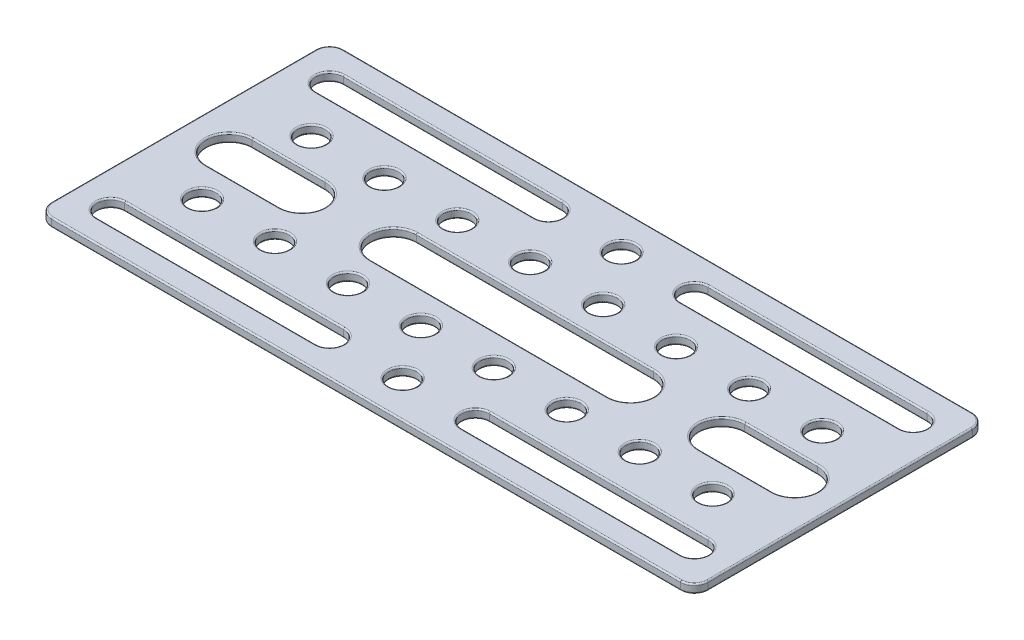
from build123d import *

# Parameters (mm, degrees)
EXTRUDE1_DEPTH          = 1.524
SKETCH2_R               = 2.413
CUT_EXTRUDE1_DEPTH      = 126.089778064
SKETCH3_R               = 2.413
CUT_EXTRUDE2_DEPTH      = 126.089778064
LPATTERN1_COUNT         = 8
LPATTERN1_PITCH         = 12.7
MIRROR1_COPY_1_SKETCH_R = 2.413
MIRROR1_COPY_1_DEPTH    = 126.089778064
MIRROR1_COPY_2_SKETCH_R = 2.413
MIRROR1_COPY_2_DEPTH    = 126.089778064
MIRROR1_COPY_3_SKETCH_R = 2.413
MIRROR1_COPY_3_DEPTH    = 126.089778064
MIRROR1_COPY_4_SKETCH_R = 2.413
MIRROR1_COPY_4_DEPTH    = 126.089778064
MIRROR1_COPY_5_SKETCH_R = 2.413
MIRROR1_COPY_5_DEPTH    = 126.089778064
MIRROR1_COPY_6_SKETCH_R = 2.413
MIRROR1_COPY_6_DEPTH    = 126.089778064
MIRROR1_COPY_7_SKETCH_R = 2.413
MIRROR1_COPY_7_DEPTH    = 126.089778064
FILLET1_R               = 0.254


with BuildPart() as part:
    # Sketch1 → Extrude1 (new body)
    with BuildSketch(Plane(origin=(0, 0, 0), x_dir=(1, 0, 0), z_dir=(0, 1, 0))):
        with BuildLine():
            Line((2.413, 0), (111.887, 0))
            ThreePointArc((111.887, 0), (113.593248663, 0.706751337), (114.3, 2.413))
            Line((114.3, 2.413), (114.3, 48.387))
            ThreePointArc((114.3, 48.387), (113.593248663, 50.093248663), (111.887, 50.8))
            Line((111.887, 50.8), (2.413, 50.8))
            ThreePointArc((2.413, 50.8), (0.706751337, 50.093248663), (0, 48.387))
            Line((0, 48.387), (0, 2.413))
            ThreePointArc((0, 2.413), (0.706751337, 0.706751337), (2.413, 0))
        make_face()
        with BuildLine():
            Line((7.9121, 29.3751), (20.6121, 29.3751))
            ThreePointArc((20.6121, 29.3751), (24.5872, 25.4), (20.6121, 21.4249))
            Line((20.6121, 21.4249), (7.9121, 21.4249))
            ThreePointArc((7.9121, 21.4249), (3.937, 25.4), (7.9121, 29.3751))
        make_face(mode=Mode.SUBTRACT)
        with BuildLine():
            Line((36.5125, 29.3751), (77.7875, 29.3751))
            ThreePointArc((77.7875, 29.3751), (81.7626, 25.4), (77.7875, 21.4249))
            Line((77.7875, 21.4249), (36.5125, 21.4249))
            ThreePointArc((36.5125, 21.4249), (32.5374, 25.4), (36.5125, 29.3751))
        make_face(mode=Mode.SUBTRACT)
        with BuildLine():
            Line((93.6879, 29.3751), (106.3879, 29.3751))
            ThreePointArc((106.3879, 29.3751), (110.363, 25.4), (106.3879, 21.4249))
            Line((106.3879, 21.4249), (93.6879, 21.4249))
            ThreePointArc((93.6879, 21.4249), (89.7128, 25.4), (93.6879, 29.3751))
        make_face(mode=Mode.SUBTRACT)
    extrude(amount=EXTRUDE1_DEPTH)

    # Sketch2 → Cut-Extrude1 (cut, through all)
    with BuildSketch(Plane(origin=(0, 1.524, 0), x_dir=(-1, 0, 0), z_dir=(0, 1, 0))):
        with Locations(Location((-57.15, -6.35, 0), (0, 0, 90))):
            Circle(SKETCH2_R)
        with BuildLine():
            Line((-6.35, -8.763), (-44.45, -8.763))
            ThreePointArc((-44.45, -8.763), (-46.863, -6.35), (-44.45, -3.937))
            Line((-44.45, -3.937), (-6.35, -3.937))
            ThreePointArc((-6.35, -3.937), (-3.937, -6.35), (-6.35, -8.763))
        make_face()
        with BuildLine():
            Line((-69.85, -3.937), (-107.95, -3.937))
            ThreePointArc((-107.95, -3.937), (-110.363, -6.35), (-107.95, -8.763))
            Line((-107.95, -8.763), (-69.85, -8.763))
            ThreePointArc((-69.85, -8.763), (-67.437, -6.35), (-69.85, -3.937))
        make_face()
    cut_extrude1 = extrude(amount=-CUT_EXTRUDE1_DEPTH, mode=Mode.SUBTRACT)

    # Sketch3 → Cut-Extrude2 (cut, through all)
    with BuildSketch(Plane(origin=(0, 1.524, 0), x_dir=(-1, 0, 0), z_dir=(0, 1, 0))):
        with Locations(Location((-12.7, -15.875, 0), (0, 0, 90))):
            Circle(SKETCH3_R)
    cut_extrude2 = extrude(amount=-CUT_EXTRUDE2_DEPTH, mode=Mode.SUBTRACT)

    # LPattern1: Cut-Extrude2 ×8
    with Locations(*[(i * LPATTERN1_PITCH, 0, 0) for i in range(1, LPATTERN1_COUNT)]):
        add(cut_extrude2, mode=Mode.SUBTRACT)

    # Mirror1: Cut-Extrude1, Cut-Extrude2 across plane
    add(cut_extrude1.mirror(Plane.XY.offset(-25.4)), mode=Mode.SUBTRACT)
    add(cut_extrude2.mirror(Plane.XY.offset(-25.4)), mode=Mode.SUBTRACT)

    # Mirror1 copy 1 sketch → Mirror1 copy 1 (cut, through all)
    with BuildSketch(Plane(origin=(12.7, 1.524, -50.8), x_dir=(-1, 0, 0), z_dir=(0, 1, 0))):
        with Locations((-12.7, 15.875)):
            Circle(MIRROR1_COPY_1_SKETCH_R)
    extrude(amount=-MIRROR1_COPY_1_DEPTH, mode=Mode.SUBTRACT)

    # Mirror1 copy 2 sketch → Mirror1 copy 2 (cut, through all)
    with BuildSketch(Plane(origin=(25.4, 1.524, -50.8), x_dir=(-1, 0, 0), z_dir=(0, 1, 0))):
        with Locations((-12.7, 15.875)):
            Circle(MIRROR1_COPY_2_SKETCH_R)
    extrude(amount=-MIRROR1_COPY_2_DEPTH, mode=Mode.SUBTRACT)

    # Mirror1 copy 3 sketch → Mirror1 copy 3 (cut, through all)
    with BuildSketch(Plane(origin=(38.1, 1.524, -50.8), x_dir=(-1, 0, 0), z_dir=(0, 1, 0))):
        with Locations((-12.7, 15.875)):
            Circle(MIRROR1_COPY_3_SKETCH_R)
    extrude(amount=-MIRROR1_COPY_3_DEPTH, mode=Mode.SUBTRACT)

    # Mirror1 copy 4 sketch → Mirror1 copy 4 (cut, through all)
    with BuildSketch(Plane(origin=(50.8, 1.524, -50.8), x_dir=(-1, 0, 0), z_dir=(0, 1, 0))):
        with Locations((-12.7, 15.875)):
            Circle(MIRROR1_COPY_4_SKETCH_R)
    extrude(amount=-MIRROR1_COPY_4_DEPTH, mode=Mode.SUBTRACT)

    # Mirror1 copy 5 sketch → Mirror1 copy 5 (cut, through all)
    with BuildSketch(Plane(origin=(63.5, 1.524, -50.8), x_dir=(-1, 0, 0), z_dir=(0, 1, 0))):
        with Locations((-12.7, 15.875)):
            Circle(MIRROR1_COPY_5_SKETCH_R)
    extrude(amount=-MIRROR1_COPY_5_DEPTH, mode=Mode.SUBTRACT)

    # Mirror1 copy 6 sketch → Mirror1 copy 6 (cut, through all)
    with BuildSketch(Plane(origin=(76.2, 1.524, -50.8), x_dir=(-1, 0, 0), z_dir=(0, 1, 0))):
        with Locations((-12.7, 15.875)):
            Circle(MIRROR1_COPY_6_SKETCH_R)
    extrude(amount=-MIRROR1_COPY_6_DEPTH, mode=Mode.SUBTRACT)

    # Mirror1 copy 7 sketch → Mirror1 copy 7 (cut, through all)
    with BuildSketch(Plane(origin=(88.9, 1.524, -50.8), x_dir=(-1, 0, 0), z_dir=(0, 1, 0))):
        with Locations((-12.7, 15.875)):
            Circle(MIRROR1_COPY_7_SKETCH_R)
    extrude(amount=-MIRROR1_COPY_7_DEPTH, mode=Mode.SUBTRACT)

    # Fillet1
    fillet1_edges = [part.edges().sort_by_distance(p)[0] for p in [
        (0.706751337, 1.524, -0.706751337),
        (12.7, 0, -18.288),
        (12.7, 1.524, -18.288),
        (25.4, 1.524, -18.288),
        (25.4, 0, -18.288),
        (38.1, 0, -18.288),
        (38.1, 1.524, -18.288),
        (50.8, 0, -18.288),
        (50.8, 1.524, -18.288),
        (63.5, 0, -18.288),
        (63.5, 1.524, -18.288),
        (76.2, 0, -18.288),
        (76.2, 1.524, -18.288),
        (88.9, 0, -18.288),
        (88.9, 1.524, -18.288),
        (101.6, 0, -18.288),
        (101.6, 1.524, -18.288),
        (3.937, 1.524, -44.45),
        (25.4, 1.524, -46.863),
        (46.863, 1.524, -44.45),
        (25.4, 1.524, -42.037),
        (3.937, 0, -44.45),
        (25.4, 0, -46.863),
        (46.863, 0, -44.45),
        (25.4, 0, -42.037),
        (57.15, 1.524, 0),
        (67.437, 1.524, -44.45),
        (88.9, 1.524, -46.863),
        (110.363, 1.524, -44.45),
        (88.9, 1.524, -42.037),
        (67.437, 0, -44.45),
        (88.9, 0, -46.863),
        (110.363, 0, -44.45),
        (88.9, 0, -42.037),
        (57.15, 1.524, -42.037),
        (57.15, 0, -42.037),
        (12.7, 1.524, -32.512),
        (12.7, 0, -32.512),
        (27.813, 1.524, -34.925),
        (27.813, 0, -34.925),
        (113.593248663, 1.524, -0.706751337),
        (40.513, 1.524, -34.925),
        (40.513, 0, -34.925),
        (53.213, 1.524, -34.925),
        (53.213, 0, -34.925),
        (65.913, 1.524, -34.925),
        (65.913, 0, -34.925),
        (78.613, 1.524, -34.925),
        (78.613, 0, -34.925),
        (91.313, 1.524, -34.925),
        (91.313, 0, -34.925),
        (104.013, 1.524, -34.925),
        (104.013, 0, -34.925),
        (114.3, 1.524, -25.4),
        (113.593248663, 1.524, -50.093248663),
        (3.937, 0, -25.4),
        (14.2621, 0, -21.4249),
        (24.5872, 0, -25.4),
        (14.2621, 0, -29.3751),
        (3.937, 1.524, -25.4),
        (14.2621, 1.524, -21.4249),
        (57.15, 1.524, -50.8),
        (24.5872, 1.524, -25.4),
        (14.2621, 1.524, -29.3751),
        (32.5374, 0, -25.4),
        (57.15, 0, -21.4249),
        (81.7626, 0, -25.4),
        (57.15, 0, -29.3751),
        (32.5374, 1.524, -25.4),
        (57.15, 1.524, -21.4249),
        (81.7626, 1.524, -25.4),
        (57.15, 1.524, -29.3751),
        (0.706751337, 1.524, -50.093248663),
        (89.7128, 0, -25.4),
        (100.0379, 0, -21.4249),
        (110.363, 0, -25.4),
        (100.0379, 0, -29.3751),
        (89.7128, 1.524, -25.4),
        (100.0379, 1.524, -21.4249),
        (110.363, 1.524, -25.4),
        (100.0379, 1.524, -29.3751),
        (57.15, 0, -50.8),
        (0, 1.524, -25.4),
        (3.937, 0, -6.35),
        (25.4, 0, -8.763),
        (46.863, 0, -6.35),
        (25.4, 0, -3.937),
        (3.937, 1.524, -6.35),
        (25.4, 1.524, -3.937),
        (113.593248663, 0, -50.093248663),
        (46.863, 1.524, -6.35),
        (25.4, 1.524, -8.763),
        (114.3, 0, -25.4),
        (113.593248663, 0, -0.706751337),
        (67.437, 0, -6.35),
        (88.9, 0, -8.763),
        (110.363, 0, -6.35),
        (57.15, 0, 0),
        (88.9, 0, -3.937),
        (67.437, 1.524, -6.35),
        (88.9, 1.524, -3.937),
        (110.363, 1.524, -6.35),
        (88.9, 1.524, -8.763),
        (0.706751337, 0, -0.706751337),
        (0, 0, -25.4),
        (57.15, 0, -8.763),
        (57.15, 1.524, -8.763),
        (0.706751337, 0, -50.093248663),
    ]]
    fillet(fillet1_edges, radius=FILLET1_R)


solid = part.part
